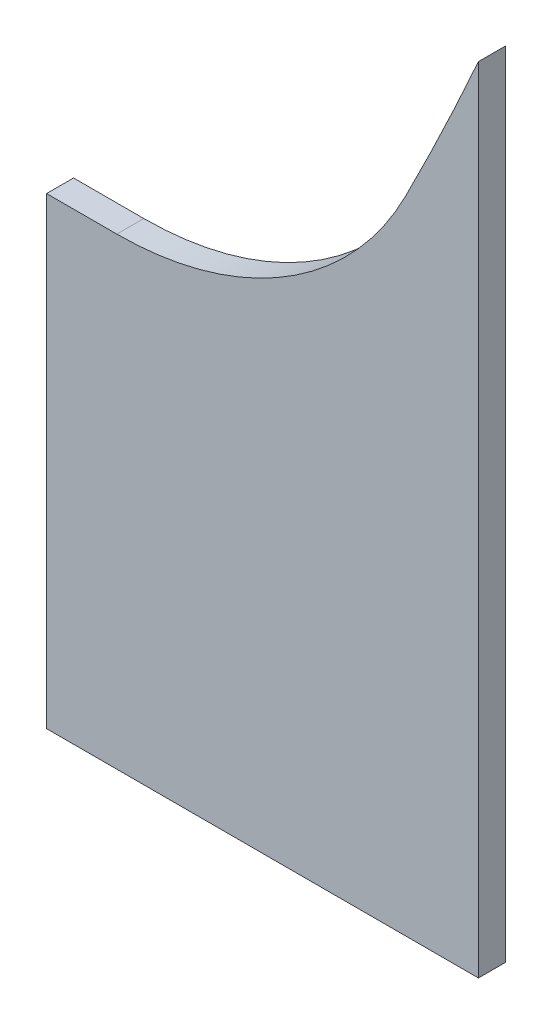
ISO-10303-21;
HEADER;
FILE_DESCRIPTION(('STEP AP214'),'2;1');
FILE_NAME('part.step','',(''),(''),'','','');
FILE_SCHEMA(('AUTOMOTIVE_DESIGN { 1 0 10303 214 1 1 1 1 }'));
ENDSEC;
DATA;
#1=APPLICATION_CONTEXT('core data for automotive mechanical design processes');
#2=APPLICATION_PROTOCOL_DEFINITION('international standard','automotive_design',2000,#1);
#3=PRODUCT_CONTEXT('',#1,'mechanical');
#4=PRODUCT('Part','Part','',(#3));
#5=PRODUCT_RELATED_PRODUCT_CATEGORY('part','',(#4));
#6=PRODUCT_DEFINITION_FORMATION('','',#4);
#7=PRODUCT_DEFINITION_CONTEXT('part definition',#1,'design');
#8=PRODUCT_DEFINITION('design','',#6,#7);
#9=PRODUCT_DEFINITION_SHAPE('','',#8);
#10=(LENGTH_UNIT() NAMED_UNIT(*) SI_UNIT(.MILLI.,.METRE.));
#11=(NAMED_UNIT(*) PLANE_ANGLE_UNIT() SI_UNIT($,.RADIAN.));
#12=(NAMED_UNIT(*) SI_UNIT($,.STERADIAN.) SOLID_ANGLE_UNIT());
#13=UNCERTAINTY_MEASURE_WITH_UNIT(LENGTH_MEASURE(1.E-05),#10,'distance_accuracy_value','');
#14=(GEOMETRIC_REPRESENTATION_CONTEXT(3) GLOBAL_UNCERTAINTY_ASSIGNED_CONTEXT((#13)) GLOBAL_UNIT_ASSIGNED_CONTEXT((#10,
#11,#12)) REPRESENTATION_CONTEXT('',''));
#15=CARTESIAN_POINT('',(0.,0.,0.));
#16=DIRECTION('',(0.,0.,1.));
#17=DIRECTION('',(1.,0.,0.));
#18=AXIS2_PLACEMENT_3D('',#15,#16,#17);
#19=CARTESIAN_POINT('',(577.,-390.85,-2.5));
#20=DIRECTION('',(-1.,0.,0.));
#21=DIRECTION('',(0.,-1.,0.));
#22=AXIS2_PLACEMENT_3D('',#19,#20,#21);
#23=PLANE('',#22);
#24=DIRECTION('',(0.,0.,1.));
#25=VECTOR('',#24,1.);
#26=CARTESIAN_POINT('',(577.,-390.85,-2.5));
#27=LINE('',#26,#25);
#28=CARTESIAN_POINT('',(577.,-390.85,-2.5));
#29=VERTEX_POINT('',#28);
#30=CARTESIAN_POINT('',(577.,-390.85,2.5));
#31=VERTEX_POINT('',#30);
#32=EDGE_CURVE('E34',#29,#31,#27,.T.);
#33=ORIENTED_EDGE('',*,*,#32,.T.);
#34=DIRECTION('',(0.,-1.,0.));
#35=VECTOR('',#34,1.);
#36=CARTESIAN_POINT('',(577.,-390.85,2.5));
#37=LINE('',#36,#35);
#38=CARTESIAN_POINT('',(577.,-305.,2.5));
#39=VERTEX_POINT('',#38);
#40=EDGE_CURVE('E83',#39,#31,#37,.T.);
#41=ORIENTED_EDGE('',*,*,#40,.F.);
#42=DIRECTION('',(0.,0.,1.));
#43=VECTOR('',#42,1.);
#44=CARTESIAN_POINT('',(577.,-305.,-2.5));
#45=LINE('',#44,#43);
#46=CARTESIAN_POINT('',(577.,-305.,-2.5));
#47=VERTEX_POINT('',#46);
#48=EDGE_CURVE('E11',#47,#39,#45,.T.);
#49=ORIENTED_EDGE('',*,*,#48,.F.);
#50=DIRECTION('',(0.,-1.,0.));
#51=VECTOR('',#50,1.);
#52=CARTESIAN_POINT('',(577.,-390.85,-2.5));
#53=LINE('',#52,#51);
#54=EDGE_CURVE('E84',#47,#29,#53,.T.);
#55=ORIENTED_EDGE('',*,*,#54,.T.);
#56=EDGE_LOOP('',(#33,#41,#49,#55));
#57=FACE_BOUND('',#56,.T.);
#58=ADVANCED_FACE('F31',(#57),#23,.T.);
#59=CARTESIAN_POINT('',(577.,-305.,-2.5));
#60=DIRECTION('',(0.,1.,0.));
#61=DIRECTION('',(-1.,0.,0.));
#62=AXIS2_PLACEMENT_3D('',#59,#60,#61);
#63=PLANE('',#62);
#64=ORIENTED_EDGE('',*,*,#48,.T.);
#65=DIRECTION('',(-1.,0.,0.));
#66=VECTOR('',#65,1.);
#67=CARTESIAN_POINT('',(577.,-305.,2.5));
#68=LINE('',#67,#66);
#69=CARTESIAN_POINT('',(590.,-305.,2.5));
#70=VERTEX_POINT('',#69);
#71=EDGE_CURVE('E101',#70,#39,#68,.T.);
#72=ORIENTED_EDGE('',*,*,#71,.F.);
#73=DIRECTION('',(0.,0.,1.));
#74=VECTOR('',#73,1.);
#75=CARTESIAN_POINT('',(590.,-305.,-2.5));
#76=LINE('',#75,#74);
#77=CARTESIAN_POINT('',(590.,-305.,-2.5));
#78=VERTEX_POINT('',#77);
#79=EDGE_CURVE('E39',#78,#70,#76,.T.);
#80=ORIENTED_EDGE('',*,*,#79,.F.);
#81=DIRECTION('',(-1.,0.,0.));
#82=VECTOR('',#81,1.);
#83=CARTESIAN_POINT('',(577.,-305.,-2.5));
#84=LINE('',#83,#82);
#85=EDGE_CURVE('E89',#78,#47,#84,.T.);
#86=ORIENTED_EDGE('',*,*,#85,.T.);
#87=EDGE_LOOP('',(#64,#72,#80,#86));
#88=FACE_BOUND('',#87,.T.);
#89=ADVANCED_FACE('F141',(#88),#63,.T.);
#90=CARTESIAN_POINT('',(590.,-245.,-2.5));
#91=DIRECTION('',(0.,0.,1.));
#92=DIRECTION('',(1.,0.,0.));
#93=AXIS2_PLACEMENT_3D('',#90,#91,#92);
#94=CYLINDRICAL_SURFACE('',#93,60.);
#95=ORIENTED_EDGE('',*,*,#79,.T.);
#96=CARTESIAN_POINT('',(590.,-245.,2.5));
#97=DIRECTION('',(0.,0.,-1.));
#98=DIRECTION('',(1.,0.,0.));
#99=AXIS2_PLACEMENT_3D('',#96,#97,#98);
#100=CIRCLE('',#99,60.);
#101=CARTESIAN_POINT('',(643.46915575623,-272.222222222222,2.5));
#102=VERTEX_POINT('',#101);
#103=EDGE_CURVE('E108',#102,#70,#100,.T.);
#104=ORIENTED_EDGE('',*,*,#103,.F.);
#105=DIRECTION('',(0.,0.,1.));
#106=VECTOR('',#105,1.);
#107=CARTESIAN_POINT('',(643.46915575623,-272.222222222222,-2.5));
#108=LINE('',#107,#106);
#109=CARTESIAN_POINT('',(643.46915575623,-272.222222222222,-2.5));
#110=VERTEX_POINT('',#109);
#111=EDGE_CURVE('E124',#110,#102,#108,.T.);
#112=ORIENTED_EDGE('',*,*,#111,.F.);
#113=CARTESIAN_POINT('',(590.,-245.,-2.5));
#114=DIRECTION('',(0.,0.,-1.));
#115=DIRECTION('',(1.,0.,0.));
#116=AXIS2_PLACEMENT_3D('',#113,#114,#115);
#117=CIRCLE('',#116,60.);
#118=EDGE_CURVE('E120',#110,#78,#117,.T.);
#119=ORIENTED_EDGE('',*,*,#118,.T.);
#120=EDGE_LOOP('',(#95,#104,#112,#119));
#121=FACE_BOUND('',#120,.T.);
#122=ADVANCED_FACE('F137',(#121),#94,.F.);
#123=CARTESIAN_POINT('',(108.777598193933,0.,-2.5));
#124=DIRECTION('',(0.,0.,1.));
#125=DIRECTION('',(1.,0.,0.));
#126=AXIS2_PLACEMENT_3D('',#123,#124,#125);
#127=CYLINDRICAL_SURFACE('',#126,600.);
#128=ORIENTED_EDGE('',*,*,#111,.T.);
#129=CARTESIAN_POINT('',(108.777598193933,0.,2.5));
#130=DIRECTION('',(0.,0.,-1.));
#131=DIRECTION('',(1.,0.,0.));
#132=AXIS2_PLACEMENT_3D('',#129,#130,#131);
#133=CIRCLE('',#132,600.);
#134=CARTESIAN_POINT('',(657.,-243.828214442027,2.5));
#135=VERTEX_POINT('',#134);
#136=EDGE_CURVE('E105',#135,#102,#133,.T.);
#137=ORIENTED_EDGE('',*,*,#136,.F.);
#138=DIRECTION('',(0.,0.,1.));
#139=VECTOR('',#138,1.);
#140=CARTESIAN_POINT('',(657.,-243.828214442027,-2.5));
#141=LINE('',#140,#139);
#142=CARTESIAN_POINT('',(657.,-243.828214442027,-2.5));
#143=VERTEX_POINT('',#142);
#144=EDGE_CURVE('E126',#143,#135,#141,.T.);
#145=ORIENTED_EDGE('',*,*,#144,.F.);
#146=CARTESIAN_POINT('',(108.777598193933,0.,-2.5));
#147=DIRECTION('',(0.,0.,-1.));
#148=DIRECTION('',(1.,0.,0.));
#149=AXIS2_PLACEMENT_3D('',#146,#147,#148);
#150=CIRCLE('',#149,600.);
#151=EDGE_CURVE('E117',#143,#110,#150,.T.);
#152=ORIENTED_EDGE('',*,*,#151,.T.);
#153=EDGE_LOOP('',(#128,#137,#145,#152));
#154=FACE_BOUND('',#153,.T.);
#155=ADVANCED_FACE('F134',(#154),#127,.F.);
#156=CARTESIAN_POINT('',(657.,-390.85,-2.5));
#157=DIRECTION('',(1.,0.,0.));
#158=DIRECTION('',(0.,0.,-1.));
#159=AXIS2_PLACEMENT_3D('',#156,#157,#158);
#160=PLANE('',#159);
#161=ORIENTED_EDGE('',*,*,#144,.T.);
#162=DIRECTION('',(0.,1.,0.));
#163=VECTOR('',#162,1.);
#164=CARTESIAN_POINT('',(657.,-390.85,2.5));
#165=LINE('',#164,#163);
#166=CARTESIAN_POINT('',(657.,-390.85,2.5));
#167=VERTEX_POINT('',#166);
#168=EDGE_CURVE('E96',#167,#135,#165,.T.);
#169=ORIENTED_EDGE('',*,*,#168,.F.);
#170=DIRECTION('',(0.,0.,1.));
#171=VECTOR('',#170,1.);
#172=CARTESIAN_POINT('',(657.,-390.85,-2.5));
#173=LINE('',#172,#171);
#174=CARTESIAN_POINT('',(657.,-390.85,-2.5));
#175=VERTEX_POINT('',#174);
#176=EDGE_CURVE('E88',#175,#167,#173,.T.);
#177=ORIENTED_EDGE('',*,*,#176,.F.);
#178=DIRECTION('',(0.,1.,0.));
#179=VECTOR('',#178,1.);
#180=CARTESIAN_POINT('',(657.,-390.85,-2.5));
#181=LINE('',#180,#179);
#182=EDGE_CURVE('E114',#175,#143,#181,.T.);
#183=ORIENTED_EDGE('',*,*,#182,.T.);
#184=EDGE_LOOP('',(#161,#169,#177,#183));
#185=FACE_BOUND('',#184,.T.);
#186=ADVANCED_FACE('F128',(#185),#160,.T.);
#187=CARTESIAN_POINT('',(577.,-390.85,-2.5));
#188=DIRECTION('',(0.,-1.,0.));
#189=DIRECTION('',(0.,0.,-1.));
#190=AXIS2_PLACEMENT_3D('',#187,#188,#189);
#191=PLANE('',#190);
#192=ORIENTED_EDGE('',*,*,#176,.T.);
#193=DIRECTION('',(1.,0.,0.));
#194=VECTOR('',#193,1.);
#195=CARTESIAN_POINT('',(577.,-390.85,2.5));
#196=LINE('',#195,#194);
#197=EDGE_CURVE('E91',#31,#167,#196,.T.);
#198=ORIENTED_EDGE('',*,*,#197,.F.);
#199=ORIENTED_EDGE('',*,*,#32,.F.);
#200=DIRECTION('',(1.,0.,0.));
#201=VECTOR('',#200,1.);
#202=CARTESIAN_POINT('',(577.,-390.85,-2.5));
#203=LINE('',#202,#201);
#204=EDGE_CURVE('E112',#29,#175,#203,.T.);
#205=ORIENTED_EDGE('',*,*,#204,.T.);
#206=EDGE_LOOP('',(#192,#198,#199,#205));
#207=FACE_BOUND('',#206,.T.);
#208=ADVANCED_FACE('F92',(#207),#191,.T.);
#209=CARTESIAN_POINT('',(590.,-245.,-2.5));
#210=DIRECTION('',(0.,0.,1.));
#211=DIRECTION('',(1.,0.,0.));
#212=AXIS2_PLACEMENT_3D('',#209,#210,#211);
#213=PLANE('',#212);
#214=ORIENTED_EDGE('',*,*,#54,.F.);
#215=ORIENTED_EDGE('',*,*,#85,.F.);
#216=ORIENTED_EDGE('',*,*,#118,.F.);
#217=ORIENTED_EDGE('',*,*,#151,.F.);
#218=ORIENTED_EDGE('',*,*,#182,.F.);
#219=ORIENTED_EDGE('',*,*,#204,.F.);
#220=EDGE_LOOP('',(#214,#215,#216,#217,#218,#219));
#221=FACE_BOUND('',#220,.T.);
#222=ADVANCED_FACE('F140',(#221),#213,.F.);
#223=CARTESIAN_POINT('',(590.,-245.,2.5));
#224=DIRECTION('',(0.,0.,1.));
#225=DIRECTION('',(1.,0.,0.));
#226=AXIS2_PLACEMENT_3D('',#223,#224,#225);
#227=PLANE('',#226);
#228=ORIENTED_EDGE('',*,*,#40,.T.);
#229=ORIENTED_EDGE('',*,*,#197,.T.);
#230=ORIENTED_EDGE('',*,*,#168,.T.);
#231=ORIENTED_EDGE('',*,*,#136,.T.);
#232=ORIENTED_EDGE('',*,*,#103,.T.);
#233=ORIENTED_EDGE('',*,*,#71,.T.);
#234=EDGE_LOOP('',(#228,#229,#230,#231,#232,#233));
#235=FACE_BOUND('',#234,.T.);
#236=ADVANCED_FACE('F99',(#235),#227,.T.);
#237=CLOSED_SHELL('',(#58,#89,#122,#155,#186,#208,#222,#236));
#238=MANIFOLD_SOLID_BREP('B2',#237);
#239=ADVANCED_BREP_SHAPE_REPRESENTATION('',(#18,#238),#14);
#240=SHAPE_DEFINITION_REPRESENTATION(#9,#239);
ENDSEC;
END-ISO-10303-21;
